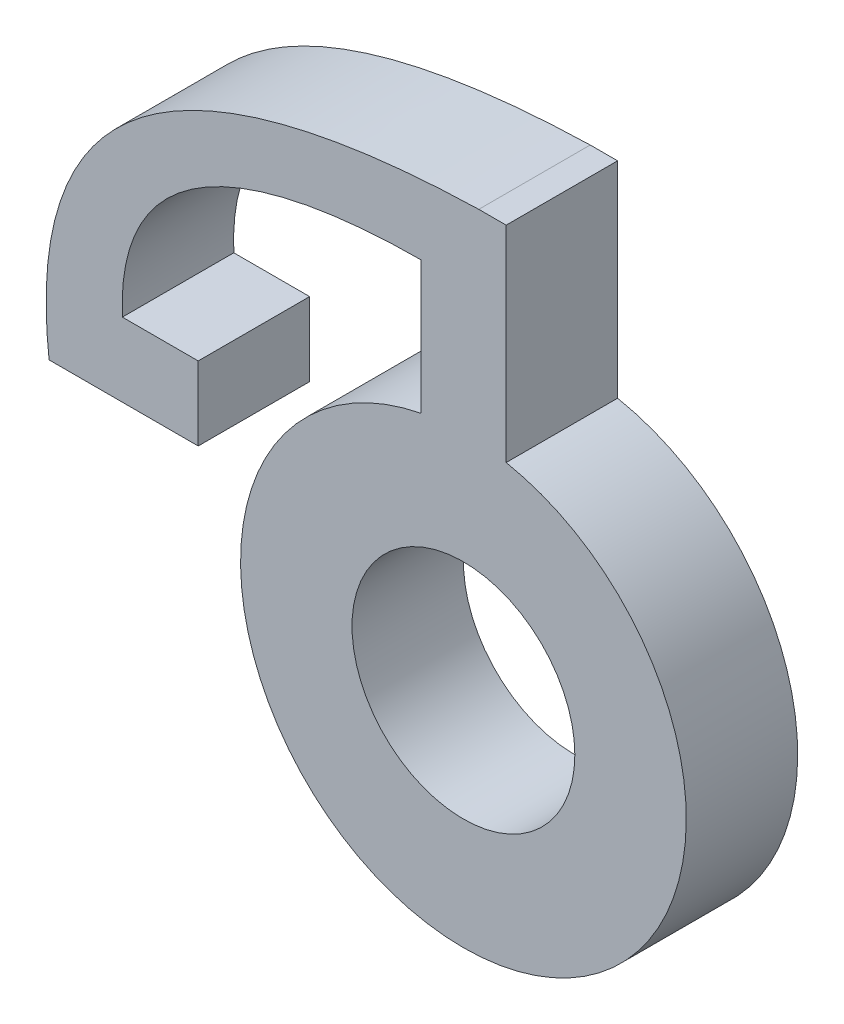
from build123d import *

# Parameters (mm, degrees)
SKETCH1_R           = 3.175
BOSS_EXTRUDE1_DEPTH = 3.175


with BuildPart() as part:
    # Sketch1 → Boss-Extrude1 (new body)
    with BuildSketch(Plane.XY):
        with BuildLine():
            Line((-11.805369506, 2.25252211), (-7.55702563, 2.25252211))
            Line((-7.55702563, 2.25252211), (-7.55702563, 4.352383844))
            Line((-7.55702563, 4.352383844), (-9.71832556, 4.352383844))
            add(Edge.make_bspline(
                [(-9.71832556, 4.352383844), (-9.927448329, 9.23191514), (-4.660548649, 10.007359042), (-1.212544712, 10.02048332)],
                knots=[0, 0, 0, 0, 0.593316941, 0.593316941, 0.593316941, 0.593316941], degree=3))
            Line((-1.212544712, 10.02048332), (-1.212544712, 6.233156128))
            ThreePointArc((-1.212544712, 6.233156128), (-0.002827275, -6.349999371), (1.218094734, 6.23207391))
            Line((1.218094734, 6.23207391), (1.218094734, 12.090521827))
            Line((1.218094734, 12.090521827), (0.437924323, 12.090521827))
            add(Edge.make_bspline(
                [(0.437924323, 12.090521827), (-12.909800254, 11.738680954), (-11.805369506, 2.25252211)],
                knots=[0, 0, 0, 1, 1, 1], degree=2))
        make_face()
        Circle(SKETCH1_R, mode=Mode.SUBTRACT)
    extrude(amount=BOSS_EXTRUDE1_DEPTH)


solid = part.part
